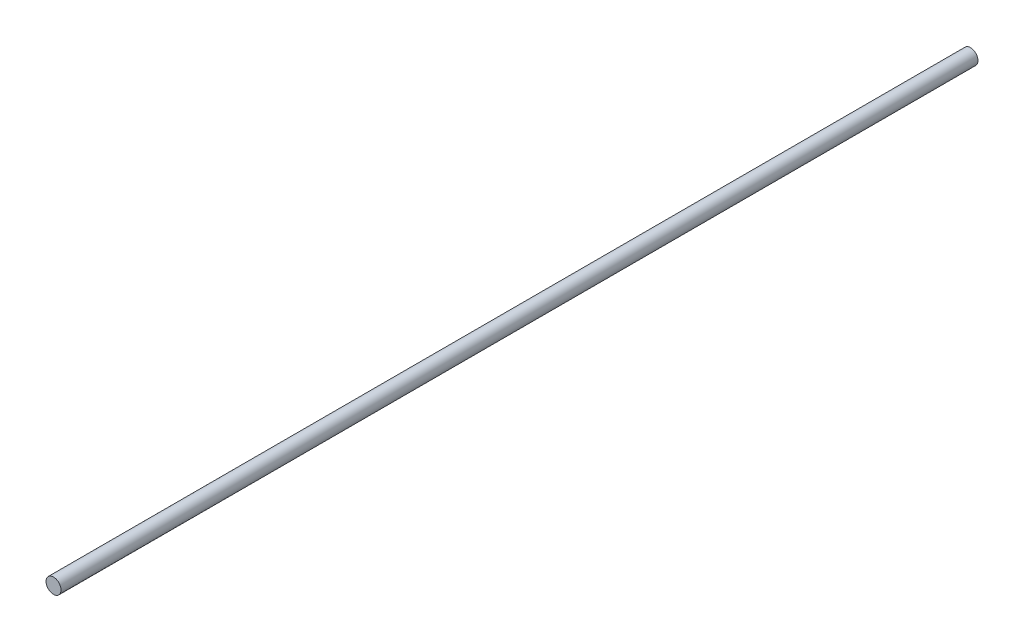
ISO-10303-21;
HEADER;
FILE_DESCRIPTION(('STEP AP214'),'2;1');
FILE_NAME('part.step','',(''),(''),'','','');
FILE_SCHEMA(('AUTOMOTIVE_DESIGN { 1 0 10303 214 1 1 1 1 }'));
ENDSEC;
DATA;
#1=APPLICATION_CONTEXT('core data for automotive mechanical design processes');
#2=APPLICATION_PROTOCOL_DEFINITION('international standard','automotive_design',2000,#1);
#3=PRODUCT_CONTEXT('',#1,'mechanical');
#4=PRODUCT('Part','Part','',(#3));
#5=PRODUCT_RELATED_PRODUCT_CATEGORY('part','',(#4));
#6=PRODUCT_DEFINITION_FORMATION('','',#4);
#7=PRODUCT_DEFINITION_CONTEXT('part definition',#1,'design');
#8=PRODUCT_DEFINITION('design','',#6,#7);
#9=PRODUCT_DEFINITION_SHAPE('','',#8);
#10=(LENGTH_UNIT() NAMED_UNIT(*) SI_UNIT(.MILLI.,.METRE.));
#11=(NAMED_UNIT(*) PLANE_ANGLE_UNIT() SI_UNIT($,.RADIAN.));
#12=(NAMED_UNIT(*) SI_UNIT($,.STERADIAN.) SOLID_ANGLE_UNIT());
#13=UNCERTAINTY_MEASURE_WITH_UNIT(LENGTH_MEASURE(1.E-05),#10,'distance_accuracy_value','');
#14=(GEOMETRIC_REPRESENTATION_CONTEXT(3) GLOBAL_UNCERTAINTY_ASSIGNED_CONTEXT((#13)) GLOBAL_UNIT_ASSIGNED_CONTEXT((#10,
#11,#12)) REPRESENTATION_CONTEXT('',''));
#15=CARTESIAN_POINT('',(0.,0.,0.));
#16=DIRECTION('',(0.,0.,1.));
#17=DIRECTION('',(1.,0.,0.));
#18=AXIS2_PLACEMENT_3D('',#15,#16,#17);
#19=CARTESIAN_POINT('',(0.,0.,774.7));
#20=DIRECTION('',(0.,0.,-1.));
#21=DIRECTION('',(-1.,0.,0.));
#22=AXIS2_PLACEMENT_3D('',#19,#20,#21);
#23=CYLINDRICAL_SURFACE('',#22,6.35);
#24=CARTESIAN_POINT('',(0.,0.,774.7));
#25=DIRECTION('',(0.,0.,1.));
#26=DIRECTION('',(1.,0.,0.));
#27=AXIS2_PLACEMENT_3D('',#24,#25,#26);
#28=CIRCLE('',#27,6.35);
#29=CARTESIAN_POINT('',(6.35,0.,774.7));
#30=VERTEX_POINT('',#29);
#31=EDGE_CURVE('E10',#30,#30,#28,.T.);
#32=ORIENTED_EDGE('',*,*,#31,.F.);
#33=EDGE_LOOP('',(#32));
#34=FACE_BOUND('',#33,.T.);
#35=CARTESIAN_POINT('',(0.,0.,0.));
#36=DIRECTION('',(0.,0.,1.));
#37=DIRECTION('',(1.,0.,0.));
#38=AXIS2_PLACEMENT_3D('',#35,#36,#37);
#39=CIRCLE('',#38,6.35);
#40=CARTESIAN_POINT('',(6.35,0.,0.));
#41=VERTEX_POINT('',#40);
#42=EDGE_CURVE('E33',#41,#41,#39,.T.);
#43=ORIENTED_EDGE('',*,*,#42,.T.);
#44=EDGE_LOOP('',(#43));
#45=FACE_BOUND('',#44,.T.);
#46=ADVANCED_FACE('F30',(#34,#45),#23,.T.);
#47=CARTESIAN_POINT('',(0.,0.,774.7));
#48=DIRECTION('',(0.,0.,1.));
#49=DIRECTION('',(1.,0.,0.));
#50=AXIS2_PLACEMENT_3D('',#47,#48,#49);
#51=PLANE('',#50);
#52=ORIENTED_EDGE('',*,*,#31,.T.);
#53=EDGE_LOOP('',(#52));
#54=FACE_BOUND('',#53,.T.);
#55=ADVANCED_FACE('F45',(#54),#51,.T.);
#56=CARTESIAN_POINT('',(0.,0.,0.));
#57=DIRECTION('',(0.,0.,1.));
#58=DIRECTION('',(1.,0.,0.));
#59=AXIS2_PLACEMENT_3D('',#56,#57,#58);
#60=PLANE('',#59);
#61=ORIENTED_EDGE('',*,*,#42,.F.);
#62=EDGE_LOOP('',(#61));
#63=FACE_BOUND('',#62,.T.);
#64=ADVANCED_FACE('F43',(#63),#60,.F.);
#65=CLOSED_SHELL('',(#46,#55,#64));
#66=MANIFOLD_SOLID_BREP('B2',#65);
#67=ADVANCED_BREP_SHAPE_REPRESENTATION('',(#18,#66),#14);
#68=SHAPE_DEFINITION_REPRESENTATION(#9,#67);
ENDSEC;
END-ISO-10303-21;
